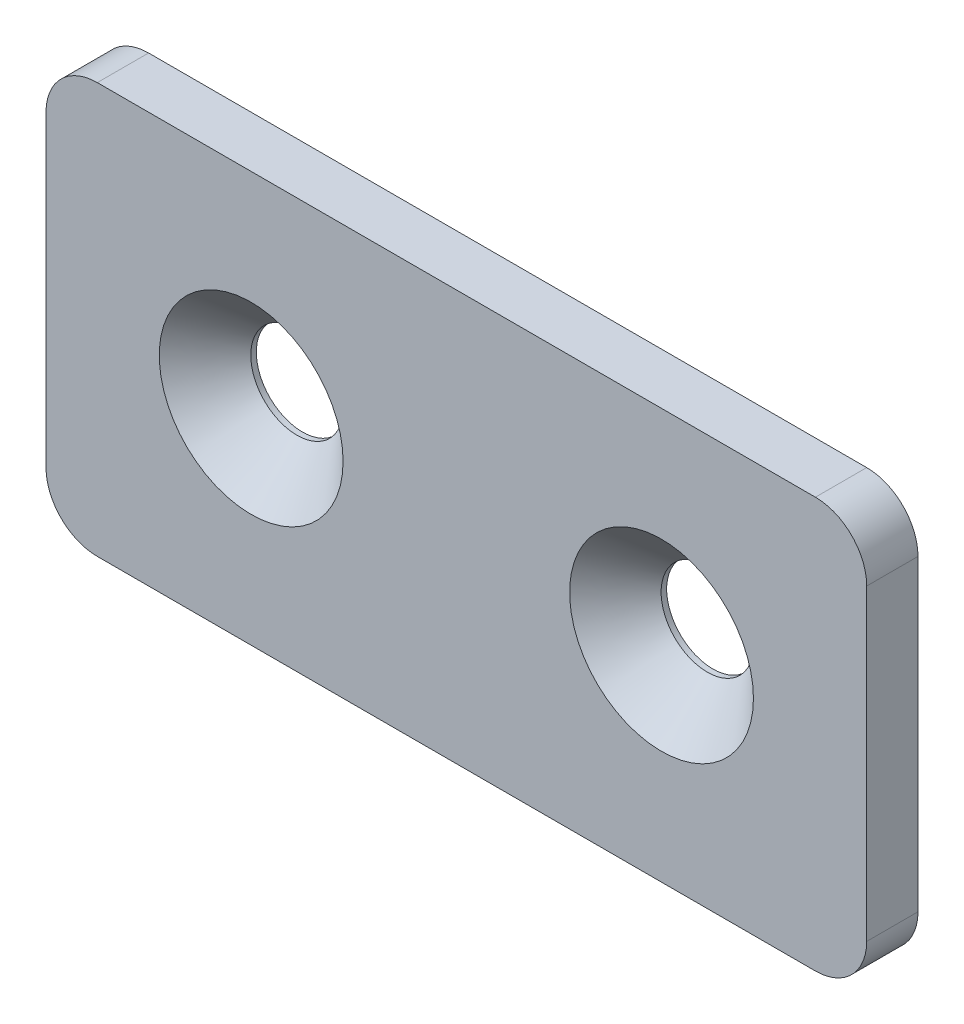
ISO-10303-21;
HEADER;
FILE_DESCRIPTION(('STEP AP214'),'2;1');
FILE_NAME('part.step','',(''),(''),'','','');
FILE_SCHEMA(('AUTOMOTIVE_DESIGN { 1 0 10303 214 1 1 1 1 }'));
ENDSEC;
DATA;
#1=APPLICATION_CONTEXT('core data for automotive mechanical design processes');
#2=APPLICATION_PROTOCOL_DEFINITION('international standard','automotive_design',2000,#1);
#3=PRODUCT_CONTEXT('',#1,'mechanical');
#4=PRODUCT('Part','Part','',(#3));
#5=PRODUCT_RELATED_PRODUCT_CATEGORY('part','',(#4));
#6=PRODUCT_DEFINITION_FORMATION('','',#4);
#7=PRODUCT_DEFINITION_CONTEXT('part definition',#1,'design');
#8=PRODUCT_DEFINITION('design','',#6,#7);
#9=PRODUCT_DEFINITION_SHAPE('','',#8);
#10=(LENGTH_UNIT() NAMED_UNIT(*) SI_UNIT(.MILLI.,.METRE.));
#11=(NAMED_UNIT(*) PLANE_ANGLE_UNIT() SI_UNIT($,.RADIAN.));
#12=(NAMED_UNIT(*) SI_UNIT($,.STERADIAN.) SOLID_ANGLE_UNIT());
#13=UNCERTAINTY_MEASURE_WITH_UNIT(LENGTH_MEASURE(1.E-05),#10,'distance_accuracy_value','');
#14=(GEOMETRIC_REPRESENTATION_CONTEXT(3) GLOBAL_UNCERTAINTY_ASSIGNED_CONTEXT((#13)) GLOBAL_UNIT_ASSIGNED_CONTEXT((#10,
#11,#12)) REPRESENTATION_CONTEXT('',''));
#15=CARTESIAN_POINT('',(0.,0.,0.));
#16=DIRECTION('',(0.,0.,1.));
#17=DIRECTION('',(1.,0.,0.));
#18=AXIS2_PLACEMENT_3D('',#15,#16,#17);
#19=CARTESIAN_POINT('',(40.,20.,5.));
#20=DIRECTION('',(-1.,0.,0.));
#21=DIRECTION('',(0.,-1.,0.));
#22=AXIS2_PLACEMENT_3D('',#19,#20,#21);
#23=PLANE('',#22);
#24=DIRECTION('',(0.,1.,0.));
#25=VECTOR('',#24,1.);
#26=CARTESIAN_POINT('',(40.,20.,5.));
#27=LINE('',#26,#25);
#28=CARTESIAN_POINT('',(40.,-15.,5.));
#29=VERTEX_POINT('',#28);
#30=CARTESIAN_POINT('',(40.,15.,5.));
#31=VERTEX_POINT('',#30);
#32=EDGE_CURVE('E123',#29,#31,#27,.T.);
#33=ORIENTED_EDGE('',*,*,#32,.F.);
#34=DIRECTION('',(0.,0.,-1.));
#35=VECTOR('',#34,1.);
#36=CARTESIAN_POINT('',(40.,-15.,5.));
#37=LINE('',#36,#35);
#38=CARTESIAN_POINT('',(40.,-15.,0.));
#39=VERTEX_POINT('',#38);
#40=EDGE_CURVE('E149',#29,#39,#37,.T.);
#41=ORIENTED_EDGE('',*,*,#40,.T.);
#42=DIRECTION('',(0.,1.,0.));
#43=VECTOR('',#42,1.);
#44=CARTESIAN_POINT('',(40.,20.,0.));
#45=LINE('',#44,#43);
#46=CARTESIAN_POINT('',(40.,15.,0.));
#47=VERTEX_POINT('',#46);
#48=EDGE_CURVE('E155',#39,#47,#45,.T.);
#49=ORIENTED_EDGE('',*,*,#48,.T.);
#50=DIRECTION('',(0.,0.,-1.));
#51=VECTOR('',#50,1.);
#52=CARTESIAN_POINT('',(40.,15.,5.));
#53=LINE('',#52,#51);
#54=EDGE_CURVE('E147',#47,#31,#53,.F.);
#55=ORIENTED_EDGE('',*,*,#54,.T.);
#56=EDGE_LOOP('',(#33,#41,#49,#55));
#57=FACE_BOUND('',#56,.T.);
#58=ADVANCED_FACE('F31',(#57),#23,.F.);
#59=CARTESIAN_POINT('',(40.,20.,5.));
#60=DIRECTION('',(0.,-1.,0.));
#61=DIRECTION('',(1.,0.,0.));
#62=AXIS2_PLACEMENT_3D('',#59,#60,#61);
#63=PLANE('',#62);
#64=DIRECTION('',(-1.,0.,0.));
#65=VECTOR('',#64,1.);
#66=CARTESIAN_POINT('',(40.,20.,5.));
#67=LINE('',#66,#65);
#68=CARTESIAN_POINT('',(35.,20.,5.));
#69=VERTEX_POINT('',#68);
#70=CARTESIAN_POINT('',(-35.,20.,5.));
#71=VERTEX_POINT('',#70);
#72=EDGE_CURVE('E126',#69,#71,#67,.T.);
#73=ORIENTED_EDGE('',*,*,#72,.F.);
#74=DIRECTION('',(0.,0.,-1.));
#75=VECTOR('',#74,1.);
#76=CARTESIAN_POINT('',(35.,20.,5.));
#77=LINE('',#76,#75);
#78=CARTESIAN_POINT('',(35.,20.,0.));
#79=VERTEX_POINT('',#78);
#80=EDGE_CURVE('E11',#69,#79,#77,.T.);
#81=ORIENTED_EDGE('',*,*,#80,.T.);
#82=DIRECTION('',(-1.,0.,0.));
#83=VECTOR('',#82,1.);
#84=CARTESIAN_POINT('',(40.,20.,0.));
#85=LINE('',#84,#83);
#86=CARTESIAN_POINT('',(-35.,20.,0.));
#87=VERTEX_POINT('',#86);
#88=EDGE_CURVE('E128',#79,#87,#85,.T.);
#89=ORIENTED_EDGE('',*,*,#88,.T.);
#90=DIRECTION('',(0.,0.,-1.));
#91=VECTOR('',#90,1.);
#92=CARTESIAN_POINT('',(-35.,20.,5.));
#93=LINE('',#92,#91);
#94=EDGE_CURVE('E39',#87,#71,#93,.F.);
#95=ORIENTED_EDGE('',*,*,#94,.T.);
#96=EDGE_LOOP('',(#73,#81,#89,#95));
#97=FACE_BOUND('',#96,.T.);
#98=ADVANCED_FACE('F199',(#97),#63,.F.);
#99=CARTESIAN_POINT('',(-40.,20.,5.));
#100=DIRECTION('',(1.,0.,0.));
#101=DIRECTION('',(0.,1.,0.));
#102=AXIS2_PLACEMENT_3D('',#99,#100,#101);
#103=PLANE('',#102);
#104=DIRECTION('',(0.,-1.,0.));
#105=VECTOR('',#104,1.);
#106=CARTESIAN_POINT('',(-40.,20.,0.));
#107=LINE('',#106,#105);
#108=CARTESIAN_POINT('',(-40.,15.,0.));
#109=VERTEX_POINT('',#108);
#110=CARTESIAN_POINT('',(-40.,-15.,0.));
#111=VERTEX_POINT('',#110);
#112=EDGE_CURVE('E124',#109,#111,#107,.T.);
#113=ORIENTED_EDGE('',*,*,#112,.T.);
#114=DIRECTION('',(0.,0.,-1.));
#115=VECTOR('',#114,1.);
#116=CARTESIAN_POINT('',(-40.,-15.,5.));
#117=LINE('',#116,#115);
#118=CARTESIAN_POINT('',(-40.,-15.,5.));
#119=VERTEX_POINT('',#118);
#120=EDGE_CURVE('E102',#111,#119,#117,.F.);
#121=ORIENTED_EDGE('',*,*,#120,.T.);
#122=DIRECTION('',(0.,-1.,0.));
#123=VECTOR('',#122,1.);
#124=CARTESIAN_POINT('',(-40.,20.,5.));
#125=LINE('',#124,#123);
#126=CARTESIAN_POINT('',(-40.,15.,5.));
#127=VERTEX_POINT('',#126);
#128=EDGE_CURVE('E167',#127,#119,#125,.T.);
#129=ORIENTED_EDGE('',*,*,#128,.F.);
#130=DIRECTION('',(0.,0.,-1.));
#131=VECTOR('',#130,1.);
#132=CARTESIAN_POINT('',(-40.,15.,5.));
#133=LINE('',#132,#131);
#134=EDGE_CURVE('E107',#127,#109,#133,.T.);
#135=ORIENTED_EDGE('',*,*,#134,.T.);
#136=EDGE_LOOP('',(#113,#121,#129,#135));
#137=FACE_BOUND('',#136,.T.);
#138=ADVANCED_FACE('F197',(#137),#103,.F.);
#139=CARTESIAN_POINT('',(40.,-20.,5.));
#140=DIRECTION('',(0.,1.,0.));
#141=DIRECTION('',(0.,0.,1.));
#142=AXIS2_PLACEMENT_3D('',#139,#140,#141);
#143=PLANE('',#142);
#144=DIRECTION('',(1.,0.,0.));
#145=VECTOR('',#144,1.);
#146=CARTESIAN_POINT('',(40.,-20.,5.));
#147=LINE('',#146,#145);
#148=CARTESIAN_POINT('',(-35.,-20.,5.));
#149=VERTEX_POINT('',#148);
#150=CARTESIAN_POINT('',(35.,-20.,5.));
#151=VERTEX_POINT('',#150);
#152=EDGE_CURVE('E117',#149,#151,#147,.T.);
#153=ORIENTED_EDGE('',*,*,#152,.F.);
#154=DIRECTION('',(0.,0.,-1.));
#155=VECTOR('',#154,1.);
#156=CARTESIAN_POINT('',(-35.,-20.,5.));
#157=LINE('',#156,#155);
#158=CARTESIAN_POINT('',(-35.,-20.,0.));
#159=VERTEX_POINT('',#158);
#160=EDGE_CURVE('E101',#149,#159,#157,.T.);
#161=ORIENTED_EDGE('',*,*,#160,.T.);
#162=DIRECTION('',(1.,0.,0.));
#163=VECTOR('',#162,1.);
#164=CARTESIAN_POINT('',(40.,-20.,0.));
#165=LINE('',#164,#163);
#166=CARTESIAN_POINT('',(35.,-20.,0.));
#167=VERTEX_POINT('',#166);
#168=EDGE_CURVE('E114',#159,#167,#165,.T.);
#169=ORIENTED_EDGE('',*,*,#168,.T.);
#170=DIRECTION('',(0.,0.,-1.));
#171=VECTOR('',#170,1.);
#172=CARTESIAN_POINT('',(35.,-20.,5.));
#173=LINE('',#172,#171);
#174=EDGE_CURVE('E119',#167,#151,#173,.F.);
#175=ORIENTED_EDGE('',*,*,#174,.T.);
#176=EDGE_LOOP('',(#153,#161,#169,#175));
#177=FACE_BOUND('',#176,.T.);
#178=ADVANCED_FACE('F113',(#177),#143,.F.);
#179=CARTESIAN_POINT('',(40.,-20.,5.));
#180=DIRECTION('',(0.,0.,-1.));
#181=DIRECTION('',(-1.,0.,0.));
#182=AXIS2_PLACEMENT_3D('',#179,#180,#181);
#183=PLANE('',#182);
#184=CARTESIAN_POINT('',(-20.,0.,5.));
#185=DIRECTION('',(0.,0.,1.));
#186=DIRECTION('',(1.,0.,0.));
#187=AXIS2_PLACEMENT_3D('',#184,#185,#186);
#188=CIRCLE('',#187,8.96);
#189=CARTESIAN_POINT('',(-11.04,0.,5.));
#190=VERTEX_POINT('',#189);
#191=EDGE_CURVE('E182',#190,#190,#188,.T.);
#192=ORIENTED_EDGE('',*,*,#191,.F.);
#193=EDGE_LOOP('',(#192));
#194=FACE_BOUND('',#193,.T.);
#195=CARTESIAN_POINT('',(20.,0.,5.));
#196=DIRECTION('',(0.,0.,1.));
#197=DIRECTION('',(1.,0.,0.));
#198=AXIS2_PLACEMENT_3D('',#195,#196,#197);
#199=CIRCLE('',#198,8.96);
#200=CARTESIAN_POINT('',(28.96,0.,5.));
#201=VERTEX_POINT('',#200);
#202=EDGE_CURVE('E173',#201,#201,#199,.T.);
#203=ORIENTED_EDGE('',*,*,#202,.F.);
#204=EDGE_LOOP('',(#203));
#205=FACE_BOUND('',#204,.T.);
#206=ORIENTED_EDGE('',*,*,#128,.T.);
#207=CARTESIAN_POINT('',(-35.,-15.,5.));
#208=DIRECTION('',(0.,0.,-1.));
#209=DIRECTION('',(-1.,0.,0.));
#210=AXIS2_PLACEMENT_3D('',#207,#208,#209);
#211=CIRCLE('',#210,5.);
#212=EDGE_CURVE('E145',#119,#149,#211,.F.);
#213=ORIENTED_EDGE('',*,*,#212,.T.);
#214=ORIENTED_EDGE('',*,*,#152,.T.);
#215=CARTESIAN_POINT('',(35.,-15.,5.));
#216=DIRECTION('',(0.,0.,-1.));
#217=DIRECTION('',(-1.,0.,0.));
#218=AXIS2_PLACEMENT_3D('',#215,#216,#217);
#219=CIRCLE('',#218,5.);
#220=EDGE_CURVE('E143',#151,#29,#219,.F.);
#221=ORIENTED_EDGE('',*,*,#220,.T.);
#222=ORIENTED_EDGE('',*,*,#32,.T.);
#223=CARTESIAN_POINT('',(35.,15.,5.));
#224=DIRECTION('',(0.,0.,-1.));
#225=DIRECTION('',(-1.,0.,0.));
#226=AXIS2_PLACEMENT_3D('',#223,#224,#225);
#227=CIRCLE('',#226,5.);
#228=EDGE_CURVE('E52',#31,#69,#227,.F.);
#229=ORIENTED_EDGE('',*,*,#228,.T.);
#230=ORIENTED_EDGE('',*,*,#72,.T.);
#231=CARTESIAN_POINT('',(-35.,15.,5.));
#232=DIRECTION('',(0.,0.,-1.));
#233=DIRECTION('',(-1.,0.,0.));
#234=AXIS2_PLACEMENT_3D('',#231,#232,#233);
#235=CIRCLE('',#234,5.);
#236=EDGE_CURVE('E140',#71,#127,#235,.F.);
#237=ORIENTED_EDGE('',*,*,#236,.T.);
#238=EDGE_LOOP('',(#206,#213,#214,#221,#222,#229,#230,#237));
#239=FACE_BOUND('',#238,.T.);
#240=ADVANCED_FACE('F188',(#194,#205,#239),#183,.F.);
#241=CARTESIAN_POINT('',(40.,-20.,0.));
#242=DIRECTION('',(0.,0.,-1.));
#243=DIRECTION('',(-1.,0.,0.));
#244=AXIS2_PLACEMENT_3D('',#241,#242,#243);
#245=PLANE('',#244);
#246=CARTESIAN_POINT('',(-20.,0.,0.));
#247=DIRECTION('',(0.,0.,1.));
#248=DIRECTION('',(1.,0.,0.));
#249=AXIS2_PLACEMENT_3D('',#246,#247,#248);
#250=CIRCLE('',#249,4.5);
#251=CARTESIAN_POINT('',(-15.5,0.,0.));
#252=VERTEX_POINT('',#251);
#253=EDGE_CURVE('E176',#252,#252,#250,.T.);
#254=ORIENTED_EDGE('',*,*,#253,.T.);
#255=EDGE_LOOP('',(#254));
#256=FACE_BOUND('',#255,.T.);
#257=CARTESIAN_POINT('',(20.,0.,0.));
#258=DIRECTION('',(0.,0.,1.));
#259=DIRECTION('',(1.,0.,0.));
#260=AXIS2_PLACEMENT_3D('',#257,#258,#259);
#261=CIRCLE('',#260,4.5);
#262=CARTESIAN_POINT('',(24.5,0.,0.));
#263=VERTEX_POINT('',#262);
#264=EDGE_CURVE('E160',#263,#263,#261,.T.);
#265=ORIENTED_EDGE('',*,*,#264,.T.);
#266=EDGE_LOOP('',(#265));
#267=FACE_BOUND('',#266,.T.);
#268=ORIENTED_EDGE('',*,*,#168,.F.);
#269=CARTESIAN_POINT('',(-35.,-15.,0.));
#270=DIRECTION('',(0.,0.,-1.));
#271=DIRECTION('',(-1.,0.,0.));
#272=AXIS2_PLACEMENT_3D('',#269,#270,#271);
#273=CIRCLE('',#272,5.);
#274=EDGE_CURVE('E97',#159,#111,#273,.T.);
#275=ORIENTED_EDGE('',*,*,#274,.T.);
#276=ORIENTED_EDGE('',*,*,#112,.F.);
#277=CARTESIAN_POINT('',(-35.,15.,0.));
#278=DIRECTION('',(0.,0.,-1.));
#279=DIRECTION('',(-1.,0.,0.));
#280=AXIS2_PLACEMENT_3D('',#277,#278,#279);
#281=CIRCLE('',#280,5.);
#282=EDGE_CURVE('E118',#109,#87,#281,.T.);
#283=ORIENTED_EDGE('',*,*,#282,.T.);
#284=ORIENTED_EDGE('',*,*,#88,.F.);
#285=CARTESIAN_POINT('',(35.,15.,0.));
#286=DIRECTION('',(0.,0.,-1.));
#287=DIRECTION('',(-1.,0.,0.));
#288=AXIS2_PLACEMENT_3D('',#285,#286,#287);
#289=CIRCLE('',#288,5.);
#290=EDGE_CURVE('E134',#79,#47,#289,.T.);
#291=ORIENTED_EDGE('',*,*,#290,.T.);
#292=ORIENTED_EDGE('',*,*,#48,.F.);
#293=CARTESIAN_POINT('',(35.,-15.,0.));
#294=DIRECTION('',(0.,0.,-1.));
#295=DIRECTION('',(-1.,0.,0.));
#296=AXIS2_PLACEMENT_3D('',#293,#294,#295);
#297=CIRCLE('',#296,5.);
#298=EDGE_CURVE('E108',#39,#167,#297,.T.);
#299=ORIENTED_EDGE('',*,*,#298,.T.);
#300=EDGE_LOOP('',(#268,#275,#276,#283,#284,#291,#292,#299));
#301=FACE_BOUND('',#300,.T.);
#302=ADVANCED_FACE('F121',(#256,#267,#301),#245,.T.);
#303=CARTESIAN_POINT('',(-35.,-15.,5.));
#304=DIRECTION('',(0.,0.,-1.));
#305=DIRECTION('',(-1.,0.,0.));
#306=AXIS2_PLACEMENT_3D('',#303,#304,#305);
#307=CYLINDRICAL_SURFACE('',#306,5.);
#308=ORIENTED_EDGE('',*,*,#212,.F.);
#309=ORIENTED_EDGE('',*,*,#120,.F.);
#310=ORIENTED_EDGE('',*,*,#274,.F.);
#311=ORIENTED_EDGE('',*,*,#160,.F.);
#312=EDGE_LOOP('',(#308,#309,#310,#311));
#313=FACE_BOUND('',#312,.T.);
#314=ADVANCED_FACE('F100',(#313),#307,.T.);
#315=CARTESIAN_POINT('',(35.,-15.,5.));
#316=DIRECTION('',(0.,0.,-1.));
#317=DIRECTION('',(-1.,0.,0.));
#318=AXIS2_PLACEMENT_3D('',#315,#316,#317);
#319=CYLINDRICAL_SURFACE('',#318,5.);
#320=ORIENTED_EDGE('',*,*,#220,.F.);
#321=ORIENTED_EDGE('',*,*,#174,.F.);
#322=ORIENTED_EDGE('',*,*,#298,.F.);
#323=ORIENTED_EDGE('',*,*,#40,.F.);
#324=EDGE_LOOP('',(#320,#321,#322,#323));
#325=FACE_BOUND('',#324,.T.);
#326=ADVANCED_FACE('F203',(#325),#319,.T.);
#327=CARTESIAN_POINT('',(35.,15.,5.));
#328=DIRECTION('',(0.,0.,-1.));
#329=DIRECTION('',(-1.,0.,0.));
#330=AXIS2_PLACEMENT_3D('',#327,#328,#329);
#331=CYLINDRICAL_SURFACE('',#330,5.);
#332=ORIENTED_EDGE('',*,*,#228,.F.);
#333=ORIENTED_EDGE('',*,*,#54,.F.);
#334=ORIENTED_EDGE('',*,*,#290,.F.);
#335=ORIENTED_EDGE('',*,*,#80,.F.);
#336=EDGE_LOOP('',(#332,#333,#334,#335));
#337=FACE_BOUND('',#336,.T.);
#338=ADVANCED_FACE('F202',(#337),#331,.T.);
#339=CARTESIAN_POINT('',(-35.,15.,5.));
#340=DIRECTION('',(0.,0.,-1.));
#341=DIRECTION('',(-1.,0.,0.));
#342=AXIS2_PLACEMENT_3D('',#339,#340,#341);
#343=CYLINDRICAL_SURFACE('',#342,5.);
#344=ORIENTED_EDGE('',*,*,#236,.F.);
#345=ORIENTED_EDGE('',*,*,#94,.F.);
#346=ORIENTED_EDGE('',*,*,#282,.F.);
#347=ORIENTED_EDGE('',*,*,#134,.F.);
#348=EDGE_LOOP('',(#344,#345,#346,#347));
#349=FACE_BOUND('',#348,.T.);
#350=ADVANCED_FACE('F33',(#349),#343,.T.);
#351=CARTESIAN_POINT('',(20.,0.,5.));
#352=DIRECTION('',(0.,0.,1.));
#353=DIRECTION('',(1.,0.,0.));
#354=AXIS2_PLACEMENT_3D('',#351,#352,#353);
#355=CYLINDRICAL_SURFACE('',#354,4.5);
#356=ORIENTED_EDGE('',*,*,#264,.F.);
#357=EDGE_LOOP('',(#356));
#358=FACE_BOUND('',#357,.T.);
#359=CARTESIAN_POINT('',(20.,0.,0.540000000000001));
#360=DIRECTION('',(0.,0.,1.));
#361=DIRECTION('',(1.,0.,0.));
#362=AXIS2_PLACEMENT_3D('',#359,#360,#361);
#363=CIRCLE('',#362,4.5);
#364=CARTESIAN_POINT('',(24.5,0.,0.540000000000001));
#365=VERTEX_POINT('',#364);
#366=EDGE_CURVE('E163',#365,#365,#363,.T.);
#367=ORIENTED_EDGE('',*,*,#366,.T.);
#368=EDGE_LOOP('',(#367));
#369=FACE_BOUND('',#368,.T.);
#370=ADVANCED_FACE('F225',(#358,#369),#355,.F.);
#371=CARTESIAN_POINT('',(20.,0.,5.));
#372=DIRECTION('',(0.,0.,1.));
#373=DIRECTION('',(1.,0.,0.));
#374=AXIS2_PLACEMENT_3D('',#371,#372,#373);
#375=CONICAL_SURFACE('',#374,8.96,0.785398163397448);
#376=ORIENTED_EDGE('',*,*,#366,.F.);
#377=EDGE_LOOP('',(#376));
#378=FACE_BOUND('',#377,.T.);
#379=ORIENTED_EDGE('',*,*,#202,.T.);
#380=EDGE_LOOP('',(#379));
#381=FACE_BOUND('',#380,.T.);
#382=ADVANCED_FACE('F228',(#378,#381),#375,.F.);
#383=CARTESIAN_POINT('',(-20.,0.,5.));
#384=DIRECTION('',(0.,0.,1.));
#385=DIRECTION('',(1.,0.,0.));
#386=AXIS2_PLACEMENT_3D('',#383,#384,#385);
#387=CYLINDRICAL_SURFACE('',#386,4.5);
#388=ORIENTED_EDGE('',*,*,#253,.F.);
#389=EDGE_LOOP('',(#388));
#390=FACE_BOUND('',#389,.T.);
#391=CARTESIAN_POINT('',(-20.,0.,0.540000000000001));
#392=DIRECTION('',(0.,0.,1.));
#393=DIRECTION('',(1.,0.,0.));
#394=AXIS2_PLACEMENT_3D('',#391,#392,#393);
#395=CIRCLE('',#394,4.5);
#396=CARTESIAN_POINT('',(-15.5,0.,0.540000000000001));
#397=VERTEX_POINT('',#396);
#398=EDGE_CURVE('E179',#397,#397,#395,.T.);
#399=ORIENTED_EDGE('',*,*,#398,.T.);
#400=EDGE_LOOP('',(#399));
#401=FACE_BOUND('',#400,.T.);
#402=ADVANCED_FACE('F232',(#390,#401),#387,.F.);
#403=CARTESIAN_POINT('',(-20.,0.,5.));
#404=DIRECTION('',(0.,0.,1.));
#405=DIRECTION('',(1.,0.,0.));
#406=AXIS2_PLACEMENT_3D('',#403,#404,#405);
#407=CONICAL_SURFACE('',#406,8.96,0.785398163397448);
#408=ORIENTED_EDGE('',*,*,#398,.F.);
#409=EDGE_LOOP('',(#408));
#410=FACE_BOUND('',#409,.T.);
#411=ORIENTED_EDGE('',*,*,#191,.T.);
#412=EDGE_LOOP('',(#411));
#413=FACE_BOUND('',#412,.T.);
#414=ADVANCED_FACE('F186',(#410,#413),#407,.F.);
#415=CLOSED_SHELL('',(#58,#98,#138,#178,#240,#302,#314,#326,#338,#350,#370,#382,#402,#414));
#416=MANIFOLD_SOLID_BREP('B2',#415);
#417=ADVANCED_BREP_SHAPE_REPRESENTATION('',(#18,#416),#14);
#418=SHAPE_DEFINITION_REPRESENTATION(#9,#417);
ENDSEC;
END-ISO-10303-21;
